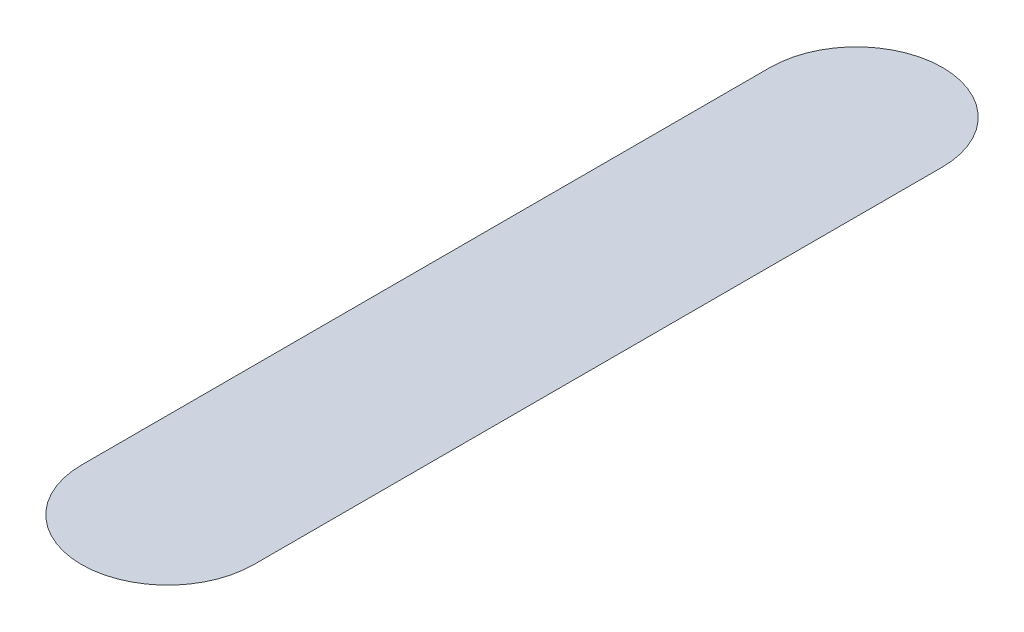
from build123d import *
from build123d.topology import SkipClean

# Parameters (mm, degrees)
SKETCH1_W           = 50
SKETCH1_H           = 5
BASE_EXTRUDE_DEPTH  = 101.6
BOSS_EXTRUDE1_DEPTH = 16.764
BOSS_REVOLVE3_ANGLE = 180
BOSS_REVOLVE4_ANGLE = 180
FILLET3_R           = 1.524
SKETCH3_W           = 203.2
SKETCH3_H           = 5
CUT_EXTRUDE1_DEPTH  = 114.347077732


with BuildPart() as part:
    # Sketch1 → Base-Extrude (new, symmetric)
    with BuildSketch(Plane.XY):
        with Locations((0, 2.5)):
            Rectangle(SKETCH1_W, SKETCH1_H)
    extrude(amount=BASE_EXTRUDE_DEPTH, both=True)

    # Sketch2 → Boss-Extrude1 (add)
    with BuildSketch(Plane.XY.offset(-8.382)):
        with BuildLine():
            Line((1.143, 0), (-1.143, 0))
            ThreePointArc((-1.143, 0), (0, -1.016), (1.143, 0))
        make_face()
    extrude(amount=BOSS_EXTRUDE1_DEPTH)

    # Sketch7 → Boss-Revolve3 (revolve)
    with SkipClean():  # the faces are left unmerged after this step: merging them gives an invalid solid
        with BuildSketch(Plane.XY.offset(8.382)):
            with BuildLine():
                Line((1.143, 0), (0, 0))
                Line((0, 0), (0, -1.016))
                ThreePointArc((0, -1.016), (0.764641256, -0.725283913), (1.143, 0))
            make_face()
            with BuildLine():
                Line((0, -1.016), (0, 0))
                Line((0, 0), (-1.143, 0))
                ThreePointArc((-1.143, 0), (-0.764641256, -0.725283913), (0, -1.016))
            make_face()
        revolve(axis=Axis((0, 0, 8.382), (0, -1, 0)), revolution_arc=BOSS_REVOLVE3_ANGLE)

    # Sketch9 → Boss-Revolve4 (revolve)
    with BuildSketch(Plane.XY.offset(-8.382)):
        with BuildLine():
            Line((0, 0), (0, -1.016))
            ThreePointArc((0, -1.016), (-0.764641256, -0.725283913), (-1.143, 0))
            Line((-1.143, 0), (0, 0))
        make_face()
    revolve(axis=Axis((0, 0, -8.382), (0, -1, 0)), revolution_arc=BOSS_REVOLVE4_ANGLE)

    # Fillet3
    fillet3_edges = [part.edges().sort_by_distance(p)[0] for p in [
        (-1.143, 0, 0),
        (1.143, 0, 0),
        (0, 0, 9.525),
        (0, 0, -9.525),
    ]]
    fillet(fillet3_edges, radius=FILLET3_R)

    # Sketch3 → Cut-Extrude1 (cut, through all)
    with BuildSketch(Plane.ZY.offset(25)):
        with Locations((0, 2.5)):
            Rectangle(SKETCH3_W, SKETCH3_H)
    extrude(amount=-CUT_EXTRUDE1_DEPTH, mode=Mode.SUBTRACT)


solid = part.part
